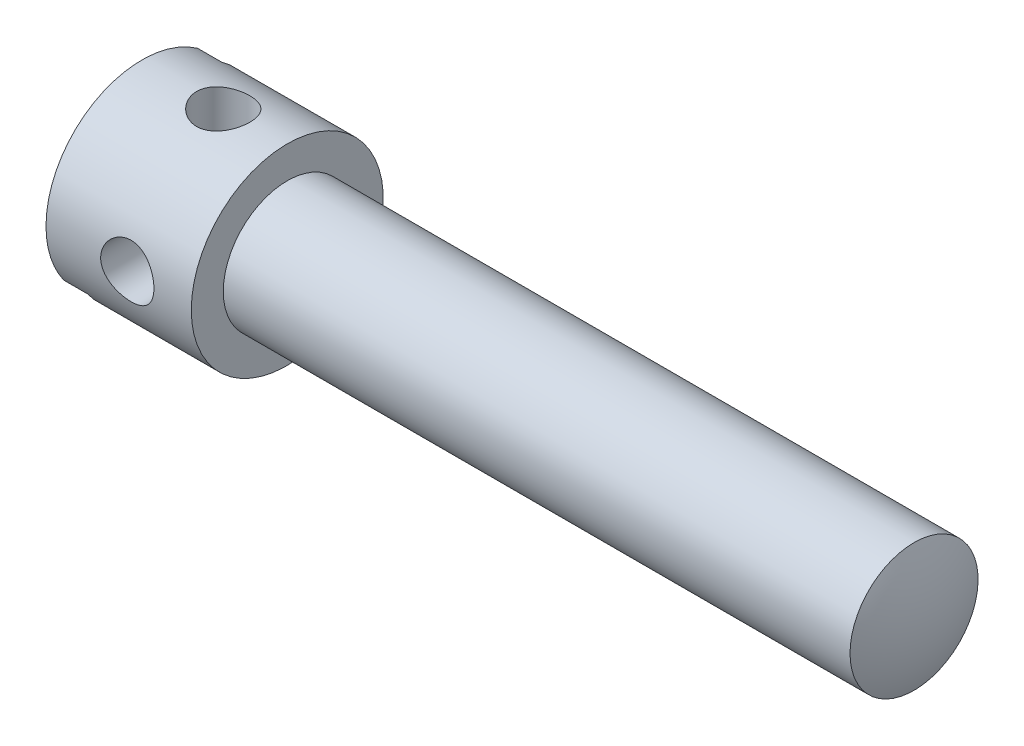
ISO-10303-21;
HEADER;
FILE_DESCRIPTION(('STEP AP214'),'2;1');
FILE_NAME('part.step','',(''),(''),'','','');
FILE_SCHEMA(('AUTOMOTIVE_DESIGN { 1 0 10303 214 1 1 1 1 }'));
ENDSEC;
DATA;
#1=APPLICATION_CONTEXT('core data for automotive mechanical design processes');
#2=APPLICATION_PROTOCOL_DEFINITION('international standard','automotive_design',2000,#1);
#3=PRODUCT_CONTEXT('',#1,'mechanical');
#4=PRODUCT('Part','Part','',(#3));
#5=PRODUCT_RELATED_PRODUCT_CATEGORY('part','',(#4));
#6=PRODUCT_DEFINITION_FORMATION('','',#4);
#7=PRODUCT_DEFINITION_CONTEXT('part definition',#1,'design');
#8=PRODUCT_DEFINITION('design','',#6,#7);
#9=PRODUCT_DEFINITION_SHAPE('','',#8);
#10=(LENGTH_UNIT() NAMED_UNIT(*) SI_UNIT(.MILLI.,.METRE.));
#11=(NAMED_UNIT(*) PLANE_ANGLE_UNIT() SI_UNIT($,.RADIAN.));
#12=(NAMED_UNIT(*) SI_UNIT($,.STERADIAN.) SOLID_ANGLE_UNIT());
#13=UNCERTAINTY_MEASURE_WITH_UNIT(LENGTH_MEASURE(1.E-05),#10,'distance_accuracy_value','');
#14=(GEOMETRIC_REPRESENTATION_CONTEXT(3) GLOBAL_UNCERTAINTY_ASSIGNED_CONTEXT((#13)) GLOBAL_UNIT_ASSIGNED_CONTEXT((#10,
#11,#12)) REPRESENTATION_CONTEXT('',''));
#15=CARTESIAN_POINT('',(0.,0.,0.));
#16=DIRECTION('',(0.,0.,1.));
#17=DIRECTION('',(1.,0.,0.));
#18=AXIS2_PLACEMENT_3D('',#15,#16,#17);
#19=CARTESIAN_POINT('',(25.,0.,0.));
#20=DIRECTION('',(-1.,0.,0.));
#21=DIRECTION('',(0.,1.,0.));
#22=AXIS2_PLACEMENT_3D('',#19,#20,#21);
#23=SPHERICAL_SURFACE('',#22,25.);
#24=CARTESIAN_POINT('',(1.15151996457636,0.,0.));
#25=DIRECTION('',(-1.,0.,0.));
#26=DIRECTION('',(0.,0.,1.));
#27=AXIS2_PLACEMENT_3D('',#24,#25,#26);
#28=CIRCLE('',#27,7.5);
#29=CARTESIAN_POINT('',(1.15151996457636,-4.34524168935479,6.11300864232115));
#30=VERTEX_POINT('',#29);
#31=CARTESIAN_POINT('',(1.15151996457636,6.11300864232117,-4.34524168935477));
#32=VERTEX_POINT('',#31);
#33=EDGE_CURVE('E186',#30,#32,#28,.T.);
#34=ORIENTED_EDGE('',*,*,#33,.T.);
#35=CARTESIAN_POINT('',(25.,0.883883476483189,0.883883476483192));
#36=DIRECTION('',(0.,0.707106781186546,0.707106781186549));
#37=DIRECTION('',(0.,-0.707106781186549,0.707106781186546));
#38=AXIS2_PLACEMENT_3D('',#35,#36,#37);
#39=CIRCLE('',#38,24.9687304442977);
#40=EDGE_CURVE('E210',#32,#30,#39,.T.);
#41=ORIENTED_EDGE('',*,*,#40,.T.);
#42=EDGE_LOOP('',(#34,#41));
#43=FACE_BOUND('',#42,.T.);
#44=ADVANCED_FACE('F43',(#43),#23,.T.);
#45=CARTESIAN_POINT('',(7.5,0.,-70.));
#46=DIRECTION('',(0.,0.,1.));
#47=DIRECTION('',(1.,0.,0.));
#48=AXIS2_PLACEMENT_3D('',#45,#46,#47);
#49=CYLINDRICAL_SURFACE('',#48,2.08);
#50=CARTESIAN_POINT('',(9.58,0.,7.5));
#51=CARTESIAN_POINT('',(9.57999765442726,-0.114492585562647,7.49999846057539));
#52=CARTESIAN_POINT('',(9.57051511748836,-0.229009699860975,7.49735271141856));
#53=CARTESIAN_POINT('',(9.5329096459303,-0.454733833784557,7.48705567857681));
#54=CARTESIAN_POINT('',(9.50477880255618,-0.565939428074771,7.47940227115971));
#55=CARTESIAN_POINT('',(9.43087004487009,-0.781750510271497,7.45993278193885));
#56=CARTESIAN_POINT('',(9.3851159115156,-0.88636467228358,7.44812231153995));
#57=CARTESIAN_POINT('',(9.27735045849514,-1.0864353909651,7.42158043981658));
#58=CARTESIAN_POINT('',(9.21533770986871,-1.18189114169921,7.40684878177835));
#59=CARTESIAN_POINT('',(9.0751855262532,-1.36331283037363,7.37563887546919));
#60=CARTESIAN_POINT('',(8.99671589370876,-1.4490182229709,7.35912888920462));
#61=CARTESIAN_POINT('',(8.82658257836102,-1.60623720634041,7.32642231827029));
#62=CARTESIAN_POINT('',(8.73491704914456,-1.67774880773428,7.31022577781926));
#63=CARTESIAN_POINT('',(8.53887601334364,-1.80585129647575,7.27965195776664));
#64=CARTESIAN_POINT('',(8.43429419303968,-1.86213684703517,7.26531454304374));
#65=CARTESIAN_POINT('',(8.21668912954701,-1.95622066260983,7.24055137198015));
#66=CARTESIAN_POINT('',(8.10366759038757,-1.99402264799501,7.23012482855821));
#67=CARTESIAN_POINT('',(7.87528987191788,-2.04915069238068,7.21469256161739));
#68=CARTESIAN_POINT('',(7.76005702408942,-2.06695166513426,7.20956135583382));
#69=CARTESIAN_POINT('',(7.52813509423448,-2.08305379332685,7.20492631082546));
#70=CARTESIAN_POINT('',(7.41144631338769,-2.0813589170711,7.20542132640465));
#71=CARTESIAN_POINT('',(7.18367824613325,-2.05889324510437,7.21187081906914));
#72=CARTESIAN_POINT('',(7.07253621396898,-2.03870319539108,7.21765907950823));
#73=CARTESIAN_POINT('',(6.8552826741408,-1.9807529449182,7.23377587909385));
#74=CARTESIAN_POINT('',(6.74917159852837,-1.94299123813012,7.24410480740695));
#75=CARTESIAN_POINT('',(6.54350723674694,-1.85051061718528,7.26828106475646));
#76=CARTESIAN_POINT('',(6.44404837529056,-1.79559285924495,7.2821692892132));
#77=CARTESIAN_POINT('',(6.25555664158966,-1.67049757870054,7.31187802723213));
#78=CARTESIAN_POINT('',(6.16652597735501,-1.60031683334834,7.32769894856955));
#79=CARTESIAN_POINT('',(5.99810698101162,-1.4437445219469,7.36017690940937));
#80=CARTESIAN_POINT('',(5.91917164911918,-1.35686697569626,7.37684371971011));
#81=CARTESIAN_POINT('',(5.77689387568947,-1.17090219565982,7.40863506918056));
#82=CARTESIAN_POINT('',(5.71355215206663,-1.07181440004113,7.42375953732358));
#83=CARTESIAN_POINT('',(5.60403739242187,-0.863503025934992,7.45086807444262));
#84=CARTESIAN_POINT('',(5.55795200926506,-0.754231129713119,7.46283602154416));
#85=CARTESIAN_POINT('',(5.48493939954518,-0.529081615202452,7.4821667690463));
#86=CARTESIAN_POINT('',(5.45800763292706,-0.41320556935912,7.48953066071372));
#87=CARTESIAN_POINT('',(5.42479116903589,-0.181998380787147,7.49865620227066));
#88=CARTESIAN_POINT('',(5.41789121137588,-0.0667620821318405,7.50058473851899));
#89=CARTESIAN_POINT('',(5.42322729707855,0.163223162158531,7.49910510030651));
#90=CARTESIAN_POINT('',(5.43546118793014,0.277972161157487,7.495697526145));
#91=CARTESIAN_POINT('',(5.4782150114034,0.501490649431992,7.48403684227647));
#92=CARTESIAN_POINT('',(5.50838673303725,0.61033200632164,7.47587606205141));
#93=CARTESIAN_POINT('',(5.58575091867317,0.821393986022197,7.45563962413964));
#94=CARTESIAN_POINT('',(5.63294529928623,0.923613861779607,7.44356352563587));
#95=CARTESIAN_POINT('',(5.74412250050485,1.1208830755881,7.41645117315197));
#96=CARTESIAN_POINT('',(5.8084333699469,1.21573960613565,7.40135869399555));
#97=CARTESIAN_POINT('',(5.95161000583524,1.39352869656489,7.36995536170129));
#98=CARTESIAN_POINT('',(6.03047888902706,1.47645869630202,7.35364424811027));
#99=CARTESIAN_POINT('',(6.2034116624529,1.63067029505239,7.32101948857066));
#100=CARTESIAN_POINT('',(6.2978675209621,1.70151642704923,7.30472112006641));
#101=CARTESIAN_POINT('',(6.4976761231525,1.8263685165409,7.27451163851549));
#102=CARTESIAN_POINT('',(6.60302844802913,1.88037512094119,7.26060043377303));
#103=CARTESIAN_POINT('',(6.82115738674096,1.96961321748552,7.23690244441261));
#104=CARTESIAN_POINT('',(6.93388865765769,2.00494913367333,7.22709278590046));
#105=CARTESIAN_POINT('',(7.16401517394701,2.05606336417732,7.21271945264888));
#106=CARTESIAN_POINT('',(7.28140909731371,2.07184718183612,7.20815430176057));
#107=CARTESIAN_POINT('',(7.51305089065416,2.08307407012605,7.20491718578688));
#108=CARTESIAN_POINT('',(7.62726234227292,2.07921992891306,7.20604159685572));
#109=CARTESIAN_POINT('',(7.8533385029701,2.05292513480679,7.21357619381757));
#110=CARTESIAN_POINT('',(7.96520328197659,2.03048503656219,7.21998622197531));
#111=CARTESIAN_POINT('',(8.1824450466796,1.9680777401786,7.23724366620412));
#112=CARTESIAN_POINT('',(8.28787156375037,1.92827091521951,7.24805042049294));
#113=CARTESIAN_POINT('',(8.49063151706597,1.83238418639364,7.27288182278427));
#114=CARTESIAN_POINT('',(8.58796358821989,1.77630154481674,7.28690701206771));
#115=CARTESIAN_POINT('',(8.77509796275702,1.64737376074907,7.31714896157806));
#116=CARTESIAN_POINT('',(8.86456475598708,1.57405456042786,7.33342100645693));
#117=CARTESIAN_POINT('',(9.03015311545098,1.41362153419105,7.36602767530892));
#118=CARTESIAN_POINT('',(9.10627137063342,1.3265042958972,7.3823623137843));
#119=CARTESIAN_POINT('',(9.244784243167,1.13845689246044,7.41371725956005));
#120=CARTESIAN_POINT('',(9.30681069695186,1.03724820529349,7.42869722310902));
#121=CARTESIAN_POINT('',(9.41287298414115,0.825425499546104,7.45520168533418));
#122=CARTESIAN_POINT('',(9.45691942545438,0.714817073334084,7.46672822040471));
#123=CARTESIAN_POINT('',(9.52057047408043,0.503981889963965,7.48368314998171));
#124=CARTESIAN_POINT('',(9.54280223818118,0.404592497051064,7.48975559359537));
#125=CARTESIAN_POINT('',(9.57251717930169,0.203475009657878,7.49791446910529));
#126=CARTESIAN_POINT('',(9.58000208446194,0.101747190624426,7.50000136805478));
#127=CARTESIAN_POINT('',(9.58,0.,7.5));
#128=B_SPLINE_CURVE_WITH_KNOTS('',3,(#50,#51,#52,#53,#54,#55,#56,#57,#58,#59,#60,#61,#62,#63,
#64,#65,#66,#67,#68,#69,#70,#71,#72,#73,#74,#75,#76,#77,#78,#79,#80,#81,#82,#83,#84,#85,#86,#87,
#88,#89,#90,#91,#92,#93,#94,#95,#96,#97,#98,#99,#100,#101,#102,#103,#104,#105,#106,#107,#108,
#109,#110,#111,#112,#113,#114,#115,#116,#117,#118,#119,#120,#121,#122,#123,#124,#125,#126,#127),
.UNSPECIFIED.,.T.,.F.,(4,2,2,2,2,2,2,2,2,2,2,2,2,2,2,2,2,2,2,2,2,2,2,2,2,2,2,2,2,2,2,2,2,2,2,2,
2,2,4),(0.,0.343104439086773,0.686354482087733,1.02914295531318,1.37196156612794,
1.72246124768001,2.07301002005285,2.43014019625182,2.78719845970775,3.13558652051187,
3.48390366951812,3.82164520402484,4.15941569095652,4.50125615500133,4.84316886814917,
5.19718726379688,5.55122195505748,5.90703131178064,6.2627563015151,6.60743352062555,
6.952071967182,7.29022919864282,7.62842451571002,7.973637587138,8.31892465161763,
8.67480584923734,9.0306733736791,9.38452890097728,9.73828480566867,10.0794716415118,
10.420648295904,10.7587389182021,11.0968864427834,11.4457287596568,11.7946574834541,
12.1518590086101,12.5088494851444,12.8137950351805,13.1187048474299),.UNSPECIFIED.);
#129=CARTESIAN_POINT('',(9.58,0.,7.5));
#130=VERTEX_POINT('',#129);
#131=EDGE_CURVE('E129',#130,#130,#128,.T.);
#132=ORIENTED_EDGE('',*,*,#131,.F.);
#133=EDGE_LOOP('',(#132));
#134=FACE_BOUND('',#133,.T.);
#135=CARTESIAN_POINT('',(7.5,0.,0.));
#136=DIRECTION('',(0.,-0.707106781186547,0.707106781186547));
#137=DIRECTION('',(0.,0.707106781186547,0.707106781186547));
#138=AXIS2_PLACEMENT_3D('',#135,#136,#137);
#139=ELLIPSE('',#138,2.94156420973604,2.08);
#140=CARTESIAN_POINT('',(5.42,0.,0.));
#141=VERTEX_POINT('',#140);
#142=CARTESIAN_POINT('',(9.58,0.,0.));
#143=VERTEX_POINT('',#142);
#144=EDGE_CURVE('E65',#141,#143,#139,.F.);
#145=ORIENTED_EDGE('',*,*,#144,.T.);
#146=CARTESIAN_POINT('',(7.5,0.,0.));
#147=DIRECTION('',(0.,0.707106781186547,0.707106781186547));
#148=DIRECTION('',(0.,-0.707106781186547,0.707106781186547));
#149=AXIS2_PLACEMENT_3D('',#146,#147,#148);
#150=ELLIPSE('',#149,2.94156420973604,2.08);
#151=EDGE_CURVE('E118',#143,#141,#150,.F.);
#152=ORIENTED_EDGE('',*,*,#151,.T.);
#153=EDGE_LOOP('',(#145,#152));
#154=FACE_BOUND('',#153,.T.);
#155=ADVANCED_FACE('F153',(#134,#154),#49,.F.);
#156=CARTESIAN_POINT('',(12.5,7.5,0.));
#157=DIRECTION('',(-1.,0.,0.));
#158=DIRECTION('',(0.,0.,1.));
#159=AXIS2_PLACEMENT_3D('',#156,#157,#158);
#160=PLANE('',#159);
#161=CARTESIAN_POINT('',(12.5,0.,0.));
#162=DIRECTION('',(-1.,0.,0.));
#163=DIRECTION('',(0.,0.,1.));
#164=AXIS2_PLACEMENT_3D('',#161,#162,#163);
#165=CIRCLE('',#164,7.5);
#166=CARTESIAN_POINT('',(12.5,0.,7.5));
#167=VERTEX_POINT('',#166);
#168=EDGE_CURVE('E185',#167,#167,#165,.T.);
#169=ORIENTED_EDGE('',*,*,#168,.F.);
#170=EDGE_LOOP('',(#169));
#171=FACE_BOUND('',#170,.T.);
#172=CARTESIAN_POINT('',(12.5,0.,0.));
#173=DIRECTION('',(-1.,0.,0.));
#174=DIRECTION('',(0.,0.,1.));
#175=AXIS2_PLACEMENT_3D('',#172,#173,#174);
#176=CIRCLE('',#175,5.);
#177=CARTESIAN_POINT('',(12.5,0.,5.));
#178=VERTEX_POINT('',#177);
#179=EDGE_CURVE('E128',#178,#178,#176,.F.);
#180=ORIENTED_EDGE('',*,*,#179,.F.);
#181=EDGE_LOOP('',(#180));
#182=FACE_BOUND('',#181,.T.);
#183=ADVANCED_FACE('F176',(#171,#182),#160,.F.);
#184=CARTESIAN_POINT('',(1.15151996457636,4.3452416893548,-6.11300864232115));
#185=VERTEX_POINT('',#184);
#186=CARTESIAN_POINT('',(1.15151996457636,-6.11300864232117,4.34524168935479));
#187=VERTEX_POINT('',#186);
#188=EDGE_CURVE('E184',#185,#187,#28,.T.);
#189=ORIENTED_EDGE('',*,*,#188,.T.);
#190=CARTESIAN_POINT('',(25.,-0.883883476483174,-0.883883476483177));
#191=DIRECTION('',(0.,-0.707106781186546,-0.707106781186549));
#192=DIRECTION('',(0.,0.707106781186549,-0.707106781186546));
#193=AXIS2_PLACEMENT_3D('',#190,#191,#192);
#194=CIRCLE('',#193,24.9687304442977);
#195=EDGE_CURVE('E95',#187,#185,#194,.T.);
#196=ORIENTED_EDGE('',*,*,#195,.T.);
#197=EDGE_LOOP('',(#189,#196));
#198=FACE_BOUND('',#197,.T.);
#199=ADVANCED_FACE('F45',(#198),#23,.T.);
#200=CARTESIAN_POINT('',(-25.0595434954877,0.,0.));
#201=DIRECTION('',(-1.,0.,0.));
#202=DIRECTION('',(0.,0.,1.));
#203=AXIS2_PLACEMENT_3D('',#200,#201,#202);
#204=CYLINDRICAL_SURFACE('',#203,7.5);
#205=CARTESIAN_POINT('',(7.5,-7.20580321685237,2.08));
#206=CARTESIAN_POINT('',(7.61439705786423,-7.20580500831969,2.07999761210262));
#207=CARTESIAN_POINT('',(7.72881871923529,-7.2085572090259,2.07053034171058));
#208=CARTESIAN_POINT('',(7.95434497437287,-7.21923238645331,2.0329909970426));
#209=CARTESIAN_POINT('',(8.06544805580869,-7.2271576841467,2.00491057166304));
#210=CARTESIAN_POINT('',(8.28104152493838,-7.24721395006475,1.93114911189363));
#211=CARTESIAN_POINT('',(8.38554146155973,-7.25933867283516,1.88549420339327));
#212=CARTESIAN_POINT('',(8.58541813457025,-7.28641953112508,1.77796294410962));
#213=CARTESIAN_POINT('',(8.68079395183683,-7.30137595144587,1.71608496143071));
#214=CARTESIAN_POINT('',(8.8622945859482,-7.33288843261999,1.57607364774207));
#215=CARTESIAN_POINT('',(8.9481360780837,-7.34947467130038,1.49757974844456));
#216=CARTESIAN_POINT('',(9.1056209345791,-7.382118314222,1.32733938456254));
#217=CARTESIAN_POINT('',(9.17726272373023,-7.39817565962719,1.2355914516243));
#218=CARTESIAN_POINT('',(9.30551097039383,-7.42829091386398,1.03946708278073));
#219=CARTESIAN_POINT('',(9.36183353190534,-7.44230908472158,0.934898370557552));
#220=CARTESIAN_POINT('',(9.45598926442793,-7.46641892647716,0.717321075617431));
#221=CARTESIAN_POINT('',(9.49382581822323,-7.47651131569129,0.604314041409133));
#222=CARTESIAN_POINT('',(9.54901218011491,-7.49141902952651,0.376027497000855));
#223=CARTESIAN_POINT('',(9.56684446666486,-7.49635842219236,0.26087286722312));
#224=CARTESIAN_POINT('',(9.58303641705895,-7.50083836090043,0.0291075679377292));
#225=CARTESIAN_POINT('',(9.58139959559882,-7.50037988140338,-0.0875028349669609));
#226=CARTESIAN_POINT('',(9.55903466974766,-7.49420565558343,-0.315503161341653));
#227=CARTESIAN_POINT('',(9.53882819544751,-7.48863355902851,-0.426948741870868));
#228=CARTESIAN_POINT('',(9.48074314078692,-7.47302924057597,-0.644800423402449));
#229=CARTESIAN_POINT('',(9.44286351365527,-7.46299675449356,-0.751206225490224));
#230=CARTESIAN_POINT('',(9.35012223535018,-7.43939033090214,-0.957261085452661));
#231=CARTESIAN_POINT('',(9.29508643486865,-7.42578031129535,-1.05682745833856));
#232=CARTESIAN_POINT('',(9.16972990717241,-7.39647836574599,-1.24548609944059));
#233=CARTESIAN_POINT('',(9.09940599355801,-7.38078600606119,-1.33457617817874));
#234=CARTESIAN_POINT('',(8.94271950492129,-7.34840005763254,-1.50286745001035));
#235=CARTESIAN_POINT('',(8.85590275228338,-7.33169052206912,-1.58164323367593));
#236=CARTESIAN_POINT('',(8.67012025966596,-7.29961810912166,-1.72362645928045));
#237=CARTESIAN_POINT('',(8.57115364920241,-7.28425532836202,-1.78683278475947));
#238=CARTESIAN_POINT('',(8.36289817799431,-7.2565478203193,-1.89624258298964));
#239=CARTESIAN_POINT('',(8.25354065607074,-7.24422542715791,-1.94232142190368));
#240=CARTESIAN_POINT('',(8.02820206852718,-7.22426670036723,-2.01529599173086));
#241=CARTESIAN_POINT('',(7.9122228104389,-7.21662909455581,-2.04219693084));
#242=CARTESIAN_POINT('',(7.68093351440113,-7.20717831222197,-2.07529988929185));
#243=CARTESIAN_POINT('',(7.5657220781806,-7.20518558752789,-2.08214023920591));
#244=CARTESIAN_POINT('',(7.33579975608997,-7.20675730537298,-2.07669397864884));
#245=CARTESIAN_POINT('',(7.22108881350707,-7.21032110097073,-2.06440959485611));
#246=CARTESIAN_POINT('',(6.99794448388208,-7.22242999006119,-2.0216272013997));
#247=CARTESIAN_POINT('',(6.88942954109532,-7.23086777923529,-1.99152120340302));
#248=CARTESIAN_POINT('',(6.67899179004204,-7.251667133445,-1.9143951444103));
#249=CARTESIAN_POINT('',(6.57706989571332,-7.26402924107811,-1.86737274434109));
#250=CARTESIAN_POINT('',(6.38006369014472,-7.29164653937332,-1.75647931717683));
#251=CARTESIAN_POINT('',(6.2851965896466,-7.30696293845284,-1.69223801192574));
#252=CARTESIAN_POINT('',(6.10735486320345,-7.33862301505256,-1.54918329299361));
#253=CARTESIAN_POINT('',(6.02438266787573,-7.35496690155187,-1.47036690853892));
#254=CARTESIAN_POINT('',(5.86999276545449,-7.38746497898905,-1.29743163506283));
#255=CARTESIAN_POINT('',(5.79902253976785,-7.40359689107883,-1.2029081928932));
#256=CARTESIAN_POINT('',(5.67395182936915,-7.43332697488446,-1.00292276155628));
#257=CARTESIAN_POINT('',(5.61985045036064,-7.44692528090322,-0.8974613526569));
#258=CARTESIAN_POINT('',(5.5305624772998,-7.46996851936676,-0.679332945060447));
#259=CARTESIAN_POINT('',(5.49523302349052,-7.47944471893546,-0.566727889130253));
#260=CARTESIAN_POINT('',(5.44408935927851,-7.49331396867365,-0.336874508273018));
#261=CARTESIAN_POINT('',(5.42827044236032,-7.49770824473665,-0.219627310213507));
#262=CARTESIAN_POINT('',(5.41691155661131,-7.50085543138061,0.012016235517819));
#263=CARTESIAN_POINT('',(5.42071765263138,-7.49979026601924,0.126378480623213));
#264=CARTESIAN_POINT('',(5.44696855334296,-7.49255502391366,0.352769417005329));
#265=CARTESIAN_POINT('',(5.46941255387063,-7.48638516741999,0.464798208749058));
#266=CARTESIAN_POINT('',(5.53192072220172,-7.46967498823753,0.682487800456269));
#267=CARTESIAN_POINT('',(5.57184268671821,-7.45916997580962,0.788192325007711));
#268=CARTESIAN_POINT('',(5.66804704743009,-7.43488350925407,0.991462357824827));
#269=CARTESIAN_POINT('',(5.72433187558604,-7.4211015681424,1.08902665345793));
#270=CARTESIAN_POINT('',(5.85352439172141,-7.39124008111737,1.27625185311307));
#271=CARTESIAN_POINT('',(5.92685863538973,-7.37510641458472,1.36560974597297));
#272=CARTESIAN_POINT('',(6.0872720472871,-7.34256376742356,1.53097176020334));
#273=CARTESIAN_POINT('',(6.174354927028,-7.32615471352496,1.60697226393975));
#274=CARTESIAN_POINT('',(6.36234048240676,-7.29445625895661,1.74530133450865));
#275=CARTESIAN_POINT('',(6.46352779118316,-7.27920380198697,1.8072523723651));
#276=CARTESIAN_POINT('',(6.67529227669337,-7.25208625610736,1.91317895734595));
#277=CARTESIAN_POINT('',(6.78586374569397,-7.24021912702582,1.95716533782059));
#278=CARTESIAN_POINT('',(6.99655703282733,-7.22272068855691,2.02069847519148));
#279=CARTESIAN_POINT('',(7.09583644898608,-7.21643050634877,2.04288167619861));
#280=CARTESIAN_POINT('',(7.29673765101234,-7.20797125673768,2.07253249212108));
#281=CARTESIAN_POINT('',(7.39835911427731,-7.20580162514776,2.08000212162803));
#282=CARTESIAN_POINT('',(7.5,-7.20580321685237,2.08));
#283=B_SPLINE_CURVE_WITH_KNOTS('',3,(#205,#206,#207,#208,#209,#210,#211,#212,#213,#214,#215,
#216,#217,#218,#219,#220,#221,#222,#223,#224,#225,#226,#227,#228,#229,#230,#231,#232,#233,#234,
#235,#236,#237,#238,#239,#240,#241,#242,#243,#244,#245,#246,#247,#248,#249,#250,#251,#252,#253,
#254,#255,#256,#257,#258,#259,#260,#261,#262,#263,#264,#265,#266,#267,#268,#269,#270,#271,#272,
#273,#274,#275,#276,#277,#278,#279,#280,#281,#282),.UNSPECIFIED.,.T.,.F.,(4,2,2,2,2,2,2,2,2,2,2,
2,2,2,2,2,2,2,2,2,2,2,2,2,2,2,2,2,2,2,2,2,2,2,2,2,2,2,4),(0.,0.342817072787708,
0.685788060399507,1.02825115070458,1.37074870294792,1.72162331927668,2.07253683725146,
2.42956807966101,2.78653396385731,3.1346916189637,3.48278642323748,3.82139242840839,
4.16001849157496,4.50220042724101,4.84445375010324,5.19804604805,5.55166369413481,
5.90780639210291,6.26385233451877,6.60843890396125,6.95298535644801,7.29022077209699,
7.62750283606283,7.97271802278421,8.31800365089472,8.6741901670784,9.03035779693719,
9.38377459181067,9.73710611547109,10.0787417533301,10.4203626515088,10.7592542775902,
11.0981962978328,11.4467608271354,11.7954196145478,12.1525593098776,12.509483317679,
12.8141153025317,13.1187055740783),.UNSPECIFIED.);
#284=CARTESIAN_POINT('',(7.5,-7.20580321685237,2.08));
#285=VERTEX_POINT('',#284);
#286=EDGE_CURVE('E192',#285,#285,#283,.T.);
#287=ORIENTED_EDGE('',*,*,#286,.T.);
#288=EDGE_LOOP('',(#287));
#289=FACE_BOUND('',#288,.T.);
#290=CARTESIAN_POINT('',(7.5,7.20580321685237,2.08));
#291=CARTESIAN_POINT('',(7.38560294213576,7.20580500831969,2.07999761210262));
#292=CARTESIAN_POINT('',(7.2711812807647,7.2085572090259,2.07053034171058));
#293=CARTESIAN_POINT('',(7.04565502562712,7.21923238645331,2.0329909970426));
#294=CARTESIAN_POINT('',(6.9345519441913,7.2271576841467,2.00491057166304));
#295=CARTESIAN_POINT('',(6.71895847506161,7.24721395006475,1.93114911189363));
#296=CARTESIAN_POINT('',(6.61445853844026,7.25933867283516,1.88549420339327));
#297=CARTESIAN_POINT('',(6.41458186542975,7.28641953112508,1.77796294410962));
#298=CARTESIAN_POINT('',(6.31920604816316,7.30137595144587,1.71608496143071));
#299=CARTESIAN_POINT('',(6.13770541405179,7.33288843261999,1.57607364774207));
#300=CARTESIAN_POINT('',(6.0518639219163,7.34947467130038,1.49757974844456));
#301=CARTESIAN_POINT('',(5.89437906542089,7.382118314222,1.32733938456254));
#302=CARTESIAN_POINT('',(5.82273727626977,7.39817565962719,1.2355914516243));
#303=CARTESIAN_POINT('',(5.69448902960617,7.42829091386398,1.03946708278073));
#304=CARTESIAN_POINT('',(5.63816646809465,7.44230908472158,0.934898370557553));
#305=CARTESIAN_POINT('',(5.54401073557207,7.46641892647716,0.717321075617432));
#306=CARTESIAN_POINT('',(5.50617418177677,7.47651131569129,0.604314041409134));
#307=CARTESIAN_POINT('',(5.45098781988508,7.49141902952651,0.376027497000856));
#308=CARTESIAN_POINT('',(5.43315553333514,7.49635842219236,0.260872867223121));
#309=CARTESIAN_POINT('',(5.41696358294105,7.50083836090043,0.0291075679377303));
#310=CARTESIAN_POINT('',(5.41860040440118,7.50037988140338,-0.0875028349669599));
#311=CARTESIAN_POINT('',(5.44096533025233,7.49420565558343,-0.315503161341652));
#312=CARTESIAN_POINT('',(5.46117180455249,7.48863355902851,-0.426948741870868));
#313=CARTESIAN_POINT('',(5.51925685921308,7.47302924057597,-0.644800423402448));
#314=CARTESIAN_POINT('',(5.55713648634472,7.46299675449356,-0.751206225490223));
#315=CARTESIAN_POINT('',(5.64987776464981,7.43939033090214,-0.957261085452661));
#316=CARTESIAN_POINT('',(5.70491356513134,7.42578031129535,-1.05682745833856));
#317=CARTESIAN_POINT('',(5.83027009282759,7.39647836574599,-1.24548609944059));
#318=CARTESIAN_POINT('',(5.90059400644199,7.38078600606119,-1.33457617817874));
#319=CARTESIAN_POINT('',(6.05728049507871,7.34840005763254,-1.50286745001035));
#320=CARTESIAN_POINT('',(6.14409724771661,7.33169052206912,-1.58164323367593));
#321=CARTESIAN_POINT('',(6.32987974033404,7.29961810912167,-1.72362645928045));
#322=CARTESIAN_POINT('',(6.42884635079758,7.28425532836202,-1.78683278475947));
#323=CARTESIAN_POINT('',(6.63710182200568,7.2565478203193,-1.89624258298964));
#324=CARTESIAN_POINT('',(6.74645934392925,7.24422542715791,-1.94232142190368));
#325=CARTESIAN_POINT('',(6.97179793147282,7.22426670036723,-2.01529599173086));
#326=CARTESIAN_POINT('',(7.08777718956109,7.21662909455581,-2.04219693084));
#327=CARTESIAN_POINT('',(7.31906648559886,7.20717831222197,-2.07529988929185));
#328=CARTESIAN_POINT('',(7.43427792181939,7.20518558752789,-2.08214023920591));
#329=CARTESIAN_POINT('',(7.66420024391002,7.20675730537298,-2.07669397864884));
#330=CARTESIAN_POINT('',(7.77891118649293,7.21032110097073,-2.06440959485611));
#331=CARTESIAN_POINT('',(8.00205551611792,7.22242999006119,-2.0216272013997));
#332=CARTESIAN_POINT('',(8.11057045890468,7.23086777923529,-1.99152120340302));
#333=CARTESIAN_POINT('',(8.32100820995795,7.251667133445,-1.9143951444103));
#334=CARTESIAN_POINT('',(8.42293010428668,7.26402924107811,-1.86737274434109));
#335=CARTESIAN_POINT('',(8.61993630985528,7.29164653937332,-1.75647931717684));
#336=CARTESIAN_POINT('',(8.7148034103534,7.30696293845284,-1.69223801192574));
#337=CARTESIAN_POINT('',(8.89264513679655,7.33862301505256,-1.54918329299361));
#338=CARTESIAN_POINT('',(8.97561733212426,7.35496690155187,-1.47036690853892));
#339=CARTESIAN_POINT('',(9.13000723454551,7.38746497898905,-1.29743163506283));
#340=CARTESIAN_POINT('',(9.20097746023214,7.40359689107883,-1.2029081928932));
#341=CARTESIAN_POINT('',(9.32604817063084,7.43332697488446,-1.00292276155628));
#342=CARTESIAN_POINT('',(9.38014954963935,7.44692528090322,-0.897461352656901));
#343=CARTESIAN_POINT('',(9.4694375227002,7.46996851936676,-0.679332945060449));
#344=CARTESIAN_POINT('',(9.50476697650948,7.47944471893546,-0.566727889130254));
#345=CARTESIAN_POINT('',(9.55591064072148,7.49331396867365,-0.336874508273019));
#346=CARTESIAN_POINT('',(9.57172955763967,7.49770824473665,-0.219627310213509));
#347=CARTESIAN_POINT('',(9.58308844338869,7.50085543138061,0.0120162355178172));
#348=CARTESIAN_POINT('',(9.57928234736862,7.49979026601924,0.126378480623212));
#349=CARTESIAN_POINT('',(9.55303144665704,7.49255502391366,0.352769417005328));
#350=CARTESIAN_POINT('',(9.53058744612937,7.48638516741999,0.464798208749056));
#351=CARTESIAN_POINT('',(9.46807927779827,7.46967498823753,0.682487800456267));
#352=CARTESIAN_POINT('',(9.42815731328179,7.45916997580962,0.788192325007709));
#353=CARTESIAN_POINT('',(9.33195295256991,7.43488350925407,0.991462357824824));
#354=CARTESIAN_POINT('',(9.27566812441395,7.4211015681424,1.08902665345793));
#355=CARTESIAN_POINT('',(9.14647560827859,7.39124008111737,1.27625185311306));
#356=CARTESIAN_POINT('',(9.07314136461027,7.37510641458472,1.36560974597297));
#357=CARTESIAN_POINT('',(8.9127279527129,7.34256376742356,1.53097176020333));
#358=CARTESIAN_POINT('',(8.825645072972,7.32615471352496,1.60697226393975));
#359=CARTESIAN_POINT('',(8.63765951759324,7.29445625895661,1.74530133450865));
#360=CARTESIAN_POINT('',(8.53647220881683,7.27920380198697,1.8072523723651));
#361=CARTESIAN_POINT('',(8.32470772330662,7.25208625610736,1.91317895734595));
#362=CARTESIAN_POINT('',(8.21413625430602,7.24021912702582,1.95716533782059));
#363=CARTESIAN_POINT('',(8.00344296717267,7.22272068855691,2.02069847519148));
#364=CARTESIAN_POINT('',(7.90416355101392,7.21643050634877,2.04288167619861));
#365=CARTESIAN_POINT('',(7.70326234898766,7.20797125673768,2.07253249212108));
#366=CARTESIAN_POINT('',(7.60164088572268,7.20580162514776,2.08000212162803));
#367=CARTESIAN_POINT('',(7.5,7.20580321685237,2.08));
#368=B_SPLINE_CURVE_WITH_KNOTS('',3,(#290,#291,#292,#293,#294,#295,#296,#297,#298,#299,#300,
#301,#302,#303,#304,#305,#306,#307,#308,#309,#310,#311,#312,#313,#314,#315,#316,#317,#318,#319,
#320,#321,#322,#323,#324,#325,#326,#327,#328,#329,#330,#331,#332,#333,#334,#335,#336,#337,#338,
#339,#340,#341,#342,#343,#344,#345,#346,#347,#348,#349,#350,#351,#352,#353,#354,#355,#356,#357,
#358,#359,#360,#361,#362,#363,#364,#365,#366,#367),.UNSPECIFIED.,.T.,.F.,(4,2,2,2,2,2,2,2,2,2,2,
2,2,2,2,2,2,2,2,2,2,2,2,2,2,2,2,2,2,2,2,2,2,2,2,2,2,2,4),(0.,0.34281707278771,0.685788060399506,
1.02825115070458,1.37074870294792,1.72162331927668,2.07253683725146,2.42956807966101,
2.78653396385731,3.13469161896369,3.48278642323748,3.82139242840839,4.16001849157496,
4.50220042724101,4.84445375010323,5.19804604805,5.55166369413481,5.90780639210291,
6.26385233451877,6.60843890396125,6.95298535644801,7.29022077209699,7.62750283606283,
7.97271802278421,8.31800365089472,8.6741901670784,9.03035779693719,9.38377459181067,
9.73710611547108,10.0787417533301,10.4203626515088,10.7592542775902,11.0981962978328,
11.4467608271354,11.7954196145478,12.1525593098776,12.509483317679,12.8141153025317,
13.1187055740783),.UNSPECIFIED.);
#369=CARTESIAN_POINT('',(7.5,7.20580321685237,2.08));
#370=VERTEX_POINT('',#369);
#371=EDGE_CURVE('E204',#370,#370,#368,.T.);
#372=ORIENTED_EDGE('',*,*,#371,.T.);
#373=EDGE_LOOP('',(#372));
#374=FACE_BOUND('',#373,.T.);
#375=ORIENTED_EDGE('',*,*,#131,.T.);
#376=EDGE_LOOP('',(#375));
#377=FACE_BOUND('',#376,.T.);
#378=CARTESIAN_POINT('',(9.58,0.,-7.5));
#379=CARTESIAN_POINT('',(9.57999765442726,0.114492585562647,-7.49999846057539));
#380=CARTESIAN_POINT('',(9.57051511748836,0.229009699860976,-7.49735271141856));
#381=CARTESIAN_POINT('',(9.5329096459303,0.454733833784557,-7.48705567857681));
#382=CARTESIAN_POINT('',(9.50477880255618,0.565939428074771,-7.47940227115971));
#383=CARTESIAN_POINT('',(9.43087004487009,0.781750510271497,-7.45993278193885));
#384=CARTESIAN_POINT('',(9.3851159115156,0.886364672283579,-7.44812231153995));
#385=CARTESIAN_POINT('',(9.27735045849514,1.0864353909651,-7.42158043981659));
#386=CARTESIAN_POINT('',(9.21533770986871,1.18189114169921,-7.40684878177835));
#387=CARTESIAN_POINT('',(9.0751855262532,1.36331283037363,-7.37563887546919));
#388=CARTESIAN_POINT('',(8.99671589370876,1.4490182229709,-7.35912888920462));
#389=CARTESIAN_POINT('',(8.82658257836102,1.60623720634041,-7.32642231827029));
#390=CARTESIAN_POINT('',(8.73491704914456,1.67774880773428,-7.31022577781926));
#391=CARTESIAN_POINT('',(8.53887601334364,1.80585129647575,-7.27965195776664));
#392=CARTESIAN_POINT('',(8.43429419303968,1.86213684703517,-7.26531454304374));
#393=CARTESIAN_POINT('',(8.21668912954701,1.95622066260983,-7.24055137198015));
#394=CARTESIAN_POINT('',(8.10366759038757,1.99402264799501,-7.23012482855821));
#395=CARTESIAN_POINT('',(7.87528987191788,2.04915069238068,-7.21469256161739));
#396=CARTESIAN_POINT('',(7.76005702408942,2.06695166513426,-7.20956135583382));
#397=CARTESIAN_POINT('',(7.52813509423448,2.08305379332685,-7.20492631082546));
#398=CARTESIAN_POINT('',(7.41144631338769,2.0813589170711,-7.20542132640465));
#399=CARTESIAN_POINT('',(7.18367824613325,2.05889324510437,-7.21187081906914));
#400=CARTESIAN_POINT('',(7.07253621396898,2.03870319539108,-7.21765907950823));
#401=CARTESIAN_POINT('',(6.8552826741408,1.9807529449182,-7.23377587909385));
#402=CARTESIAN_POINT('',(6.74917159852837,1.94299123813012,-7.24410480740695));
#403=CARTESIAN_POINT('',(6.54350723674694,1.85051061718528,-7.26828106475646));
#404=CARTESIAN_POINT('',(6.44404837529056,1.79559285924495,-7.2821692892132));
#405=CARTESIAN_POINT('',(6.25555664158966,1.67049757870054,-7.31187802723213));
#406=CARTESIAN_POINT('',(6.16652597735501,1.60031683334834,-7.32769894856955));
#407=CARTESIAN_POINT('',(5.99810698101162,1.4437445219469,-7.36017690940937));
#408=CARTESIAN_POINT('',(5.91917164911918,1.35686697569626,-7.37684371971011));
#409=CARTESIAN_POINT('',(5.77689387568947,1.17090219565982,-7.40863506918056));
#410=CARTESIAN_POINT('',(5.71355215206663,1.07181440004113,-7.42375953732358));
#411=CARTESIAN_POINT('',(5.60403739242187,0.863503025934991,-7.45086807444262));
#412=CARTESIAN_POINT('',(5.55795200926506,0.754231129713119,-7.46283602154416));
#413=CARTESIAN_POINT('',(5.48493939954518,0.529081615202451,-7.4821667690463));
#414=CARTESIAN_POINT('',(5.45800763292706,0.41320556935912,-7.48953066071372));
#415=CARTESIAN_POINT('',(5.42479116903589,0.181998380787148,-7.49865620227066));
#416=CARTESIAN_POINT('',(5.41789121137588,0.0667620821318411,-7.50058473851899));
#417=CARTESIAN_POINT('',(5.42322729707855,-0.16322316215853,-7.49910510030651));
#418=CARTESIAN_POINT('',(5.43546118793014,-0.277972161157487,-7.495697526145));
#419=CARTESIAN_POINT('',(5.4782150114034,-0.501490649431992,-7.48403684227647));
#420=CARTESIAN_POINT('',(5.50838673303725,-0.61033200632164,-7.47587606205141));
#421=CARTESIAN_POINT('',(5.58575091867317,-0.821393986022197,-7.45563962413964));
#422=CARTESIAN_POINT('',(5.63294529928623,-0.923613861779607,-7.44356352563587));
#423=CARTESIAN_POINT('',(5.74412250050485,-1.1208830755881,-7.41645117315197));
#424=CARTESIAN_POINT('',(5.8084333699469,-1.21573960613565,-7.40135869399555));
#425=CARTESIAN_POINT('',(5.95161000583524,-1.39352869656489,-7.36995536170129));
#426=CARTESIAN_POINT('',(6.03047888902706,-1.47645869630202,-7.35364424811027));
#427=CARTESIAN_POINT('',(6.2034116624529,-1.63067029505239,-7.32101948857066));
#428=CARTESIAN_POINT('',(6.2978675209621,-1.70151642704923,-7.30472112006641));
#429=CARTESIAN_POINT('',(6.4976761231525,-1.8263685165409,-7.27451163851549));
#430=CARTESIAN_POINT('',(6.60302844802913,-1.88037512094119,-7.26060043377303));
#431=CARTESIAN_POINT('',(6.82115738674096,-1.96961321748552,-7.23690244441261));
#432=CARTESIAN_POINT('',(6.93388865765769,-2.00494913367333,-7.22709278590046));
#433=CARTESIAN_POINT('',(7.16401517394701,-2.05606336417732,-7.21271945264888));
#434=CARTESIAN_POINT('',(7.28140909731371,-2.07184718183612,-7.20815430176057));
#435=CARTESIAN_POINT('',(7.51305089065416,-2.08307407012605,-7.20491718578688));
#436=CARTESIAN_POINT('',(7.62726234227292,-2.07921992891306,-7.20604159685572));
#437=CARTESIAN_POINT('',(7.8533385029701,-2.05292513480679,-7.21357619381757));
#438=CARTESIAN_POINT('',(7.96520328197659,-2.03048503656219,-7.21998622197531));
#439=CARTESIAN_POINT('',(8.1824450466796,-1.9680777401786,-7.23724366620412));
#440=CARTESIAN_POINT('',(8.28787156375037,-1.92827091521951,-7.24805042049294));
#441=CARTESIAN_POINT('',(8.49063151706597,-1.83238418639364,-7.27288182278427));
#442=CARTESIAN_POINT('',(8.58796358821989,-1.77630154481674,-7.28690701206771));
#443=CARTESIAN_POINT('',(8.77509796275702,-1.64737376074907,-7.31714896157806));
#444=CARTESIAN_POINT('',(8.86456475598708,-1.57405456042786,-7.33342100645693));
#445=CARTESIAN_POINT('',(9.03015311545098,-1.41362153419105,-7.36602767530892));
#446=CARTESIAN_POINT('',(9.10627137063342,-1.3265042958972,-7.3823623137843));
#447=CARTESIAN_POINT('',(9.244784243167,-1.13845689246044,-7.41371725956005));
#448=CARTESIAN_POINT('',(9.30681069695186,-1.03724820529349,-7.42869722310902));
#449=CARTESIAN_POINT('',(9.41287298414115,-0.825425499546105,-7.45520168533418));
#450=CARTESIAN_POINT('',(9.45691942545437,-0.714817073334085,-7.46672822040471));
#451=CARTESIAN_POINT('',(9.52057047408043,-0.503981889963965,-7.48368314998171));
#452=CARTESIAN_POINT('',(9.54280223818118,-0.404592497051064,-7.48975559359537));
#453=CARTESIAN_POINT('',(9.57251717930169,-0.203475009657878,-7.49791446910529));
#454=CARTESIAN_POINT('',(9.58000208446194,-0.101747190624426,-7.50000136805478));
#455=CARTESIAN_POINT('',(9.58,0.,-7.5));
#456=B_SPLINE_CURVE_WITH_KNOTS('',3,(#378,#379,#380,#381,#382,#383,#384,#385,#386,#387,#388,
#389,#390,#391,#392,#393,#394,#395,#396,#397,#398,#399,#400,#401,#402,#403,#404,#405,#406,#407,
#408,#409,#410,#411,#412,#413,#414,#415,#416,#417,#418,#419,#420,#421,#422,#423,#424,#425,#426,
#427,#428,#429,#430,#431,#432,#433,#434,#435,#436,#437,#438,#439,#440,#441,#442,#443,#444,#445,
#446,#447,#448,#449,#450,#451,#452,#453,#454,#455),.UNSPECIFIED.,.T.,.F.,(4,2,2,2,2,2,2,2,2,2,2,
2,2,2,2,2,2,2,2,2,2,2,2,2,2,2,2,2,2,2,2,2,2,2,2,2,2,2,4),(0.,0.343104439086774,
0.686354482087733,1.02914295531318,1.37196156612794,1.72246124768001,2.07301002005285,
2.43014019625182,2.78719845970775,3.13558652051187,3.48390366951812,3.82164520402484,
4.15941569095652,4.50125615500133,4.84316886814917,5.19718726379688,5.55122195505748,
5.90703131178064,6.2627563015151,6.60743352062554,6.952071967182,7.29022919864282,
7.62842451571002,7.973637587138,8.31892465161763,8.67480584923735,9.0306733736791,
9.38452890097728,9.73828480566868,10.0794716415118,10.420648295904,10.7587389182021,
11.0968864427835,11.4457287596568,11.7946574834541,12.1518590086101,12.5088494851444,
12.8137950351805,13.1187048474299),.UNSPECIFIED.);
#457=CARTESIAN_POINT('',(9.58,0.,-7.5));
#458=VERTEX_POINT('',#457);
#459=EDGE_CURVE('E138',#458,#458,#456,.T.);
#460=ORIENTED_EDGE('',*,*,#459,.T.);
#461=EDGE_LOOP('',(#460));
#462=FACE_BOUND('',#461,.T.);
#463=ORIENTED_EDGE('',*,*,#33,.F.);
#464=DIRECTION('',(-1.,0.,0.));
#465=VECTOR('',#464,1.);
#466=CARTESIAN_POINT('',(-25.0595434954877,-4.34524168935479,6.11300864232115));
#467=LINE('',#466,#465);
#468=CARTESIAN_POINT('',(3.,-4.34524168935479,6.11300864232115));
#469=VERTEX_POINT('',#468);
#470=EDGE_CURVE('E11',#30,#469,#467,.F.);
#471=ORIENTED_EDGE('',*,*,#470,.T.);
#472=CARTESIAN_POINT('',(3.,0.,0.));
#473=DIRECTION('',(1.,0.,0.));
#474=DIRECTION('',(0.,0.,-1.));
#475=AXIS2_PLACEMENT_3D('',#472,#473,#474);
#476=CIRCLE('',#475,7.5);
#477=CARTESIAN_POINT('',(3.,-6.11300864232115,4.34524168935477));
#478=VERTEX_POINT('',#477);
#479=EDGE_CURVE('E51',#469,#478,#476,.T.);
#480=ORIENTED_EDGE('',*,*,#479,.T.);
#481=DIRECTION('',(-1.,0.,0.));
#482=VECTOR('',#481,1.);
#483=CARTESIAN_POINT('',(-25.0595434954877,-6.11300864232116,4.34524168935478));
#484=LINE('',#483,#482);
#485=EDGE_CURVE('E92',#478,#187,#484,.T.);
#486=ORIENTED_EDGE('',*,*,#485,.T.);
#487=ORIENTED_EDGE('',*,*,#188,.F.);
#488=DIRECTION('',(-1.,0.,0.));
#489=VECTOR('',#488,1.);
#490=CARTESIAN_POINT('',(-25.0595434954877,4.3452416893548,-6.11300864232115));
#491=LINE('',#490,#489);
#492=CARTESIAN_POINT('',(3.,4.3452416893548,-6.11300864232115));
#493=VERTEX_POINT('',#492);
#494=EDGE_CURVE('E116',#185,#493,#491,.F.);
#495=ORIENTED_EDGE('',*,*,#494,.T.);
#496=CARTESIAN_POINT('',(3.,6.11300864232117,-4.34524168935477));
#497=VERTEX_POINT('',#496);
#498=EDGE_CURVE('E106',#493,#497,#476,.T.);
#499=ORIENTED_EDGE('',*,*,#498,.T.);
#500=DIRECTION('',(-1.,0.,0.));
#501=VECTOR('',#500,1.);
#502=CARTESIAN_POINT('',(-25.0595434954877,6.11300864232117,-4.34524168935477));
#503=LINE('',#502,#501);
#504=EDGE_CURVE('E100',#497,#32,#503,.T.);
#505=ORIENTED_EDGE('',*,*,#504,.T.);
#506=EDGE_LOOP('',(#463,#471,#480,#486,#487,#495,#499,#505));
#507=FACE_BOUND('',#506,.T.);
#508=ORIENTED_EDGE('',*,*,#168,.T.);
#509=EDGE_LOOP('',(#508));
#510=FACE_BOUND('',#509,.T.);
#511=ADVANCED_FACE('F111',(#289,#374,#377,#462,#507,#510),#204,.T.);
#512=CARTESIAN_POINT('',(62.4999999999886,0.,0.));
#513=DIRECTION('',(-1.,0.,0.));
#514=DIRECTION('',(0.,0.,1.));
#515=AXIS2_PLACEMENT_3D('',#512,#513,#514);
#516=CYLINDRICAL_SURFACE('',#515,5.);
#517=CARTESIAN_POINT('',(61.4564392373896,0.,0.));
#518=DIRECTION('',(-1.,0.,0.));
#519=DIRECTION('',(0.,0.,1.));
#520=AXIS2_PLACEMENT_3D('',#517,#518,#519);
#521=CIRCLE('',#520,5.);
#522=CARTESIAN_POINT('',(61.4564392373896,0.,5.));
#523=VERTEX_POINT('',#522);
#524=EDGE_CURVE('E137',#523,#523,#521,.T.);
#525=ORIENTED_EDGE('',*,*,#524,.T.);
#526=EDGE_LOOP('',(#525));
#527=FACE_BOUND('',#526,.T.);
#528=ORIENTED_EDGE('',*,*,#179,.T.);
#529=EDGE_LOOP('',(#528));
#530=FACE_BOUND('',#529,.T.);
#531=ADVANCED_FACE('F159',(#527,#530),#516,.T.);
#532=CARTESIAN_POINT('',(50.,0.,0.));
#533=DIRECTION('',(1.,0.,0.));
#534=DIRECTION('',(0.,1.,0.));
#535=AXIS2_PLACEMENT_3D('',#532,#533,#534);
#536=SPHERICAL_SURFACE('',#535,12.5);
#537=CARTESIAN_POINT('',(62.5,0.,0.));
#538=VERTEX_POINT('',#537);
#539=VERTEX_LOOP('',#538);
#540=FACE_BOUND('',#539,.T.);
#541=ORIENTED_EDGE('',*,*,#524,.F.);
#542=EDGE_LOOP('',(#541));
#543=FACE_BOUND('',#542,.T.);
#544=ADVANCED_FACE('F151',(#540,#543),#536,.T.);
#545=CARTESIAN_POINT('',(7.5,0.,0.));
#546=DIRECTION('',(0.,-0.707106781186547,0.707106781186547));
#547=DIRECTION('',(0.,0.707106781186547,0.707106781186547));
#548=AXIS2_PLACEMENT_3D('',#545,#546,#547);
#549=ELLIPSE('',#548,2.94156420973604,2.08);
#550=EDGE_CURVE('E124',#141,#143,#549,.T.);
#551=ORIENTED_EDGE('',*,*,#550,.T.);
#552=CARTESIAN_POINT('',(7.5,0.,0.));
#553=DIRECTION('',(0.,0.707106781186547,0.707106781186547));
#554=DIRECTION('',(0.,-0.707106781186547,0.707106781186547));
#555=AXIS2_PLACEMENT_3D('',#552,#553,#554);
#556=ELLIPSE('',#555,2.94156420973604,2.08);
#557=EDGE_CURVE('E119',#143,#141,#556,.T.);
#558=ORIENTED_EDGE('',*,*,#557,.T.);
#559=EDGE_LOOP('',(#551,#558));
#560=FACE_BOUND('',#559,.T.);
#561=ORIENTED_EDGE('',*,*,#459,.F.);
#562=EDGE_LOOP('',(#561));
#563=FACE_BOUND('',#562,.T.);
#564=ADVANCED_FACE('F145',(#560,#563),#49,.F.);
#565=CARTESIAN_POINT('',(7.5,-70.,0.));
#566=DIRECTION('',(0.,1.,0.));
#567=DIRECTION('',(0.,0.,1.));
#568=AXIS2_PLACEMENT_3D('',#565,#566,#567);
#569=CYLINDRICAL_SURFACE('',#568,2.08);
#570=ORIENTED_EDGE('',*,*,#144,.F.);
#571=ORIENTED_EDGE('',*,*,#557,.F.);
#572=EDGE_LOOP('',(#570,#571));
#573=FACE_BOUND('',#572,.T.);
#574=ORIENTED_EDGE('',*,*,#371,.F.);
#575=EDGE_LOOP('',(#574));
#576=FACE_BOUND('',#575,.T.);
#577=ADVANCED_FACE('F150',(#573,#576),#569,.F.);
#578=ORIENTED_EDGE('',*,*,#550,.F.);
#579=ORIENTED_EDGE('',*,*,#151,.F.);
#580=EDGE_LOOP('',(#578,#579));
#581=FACE_BOUND('',#580,.T.);
#582=ORIENTED_EDGE('',*,*,#286,.F.);
#583=EDGE_LOOP('',(#582));
#584=FACE_BOUND('',#583,.T.);
#585=ADVANCED_FACE('F154',(#581,#584),#569,.F.);
#586=CARTESIAN_POINT('',(0.,50.3813581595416,-48.6135912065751));
#587=DIRECTION('',(0.,0.707106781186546,0.707106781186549));
#588=DIRECTION('',(0.,-0.707106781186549,0.707106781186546));
#589=AXIS2_PLACEMENT_3D('',#586,#587,#588);
#590=PLANE('',#589);
#591=DIRECTION('',(0.,-0.707106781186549,0.707106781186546));
#592=VECTOR('',#591,1.);
#593=CARTESIAN_POINT('',(3.,50.3813581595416,-48.6135912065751));
#594=LINE('',#593,#592);
#595=EDGE_CURVE('E108',#497,#469,#594,.T.);
#596=ORIENTED_EDGE('',*,*,#595,.T.);
#597=ORIENTED_EDGE('',*,*,#470,.F.);
#598=ORIENTED_EDGE('',*,*,#40,.F.);
#599=ORIENTED_EDGE('',*,*,#504,.F.);
#600=EDGE_LOOP('',(#596,#597,#598,#599));
#601=FACE_BOUND('',#600,.T.);
#602=ADVANCED_FACE('F215',(#601),#590,.F.);
#603=CARTESIAN_POINT('',(3.,50.3813581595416,-48.6135912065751));
#604=DIRECTION('',(1.,0.,0.));
#605=DIRECTION('',(0.,0.,-1.));
#606=AXIS2_PLACEMENT_3D('',#603,#604,#605);
#607=PLANE('',#606);
#608=DIRECTION('',(0.,-0.707106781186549,0.707106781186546));
#609=VECTOR('',#608,1.);
#610=CARTESIAN_POINT('',(3.,48.6135912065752,-50.3813581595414));
#611=LINE('',#610,#609);
#612=EDGE_CURVE('E58',#493,#478,#611,.T.);
#613=ORIENTED_EDGE('',*,*,#612,.T.);
#614=ORIENTED_EDGE('',*,*,#479,.F.);
#615=ORIENTED_EDGE('',*,*,#595,.F.);
#616=ORIENTED_EDGE('',*,*,#498,.F.);
#617=EDGE_LOOP('',(#613,#614,#615,#616));
#618=FACE_BOUND('',#617,.T.);
#619=ADVANCED_FACE('F102',(#618),#607,.F.);
#620=CARTESIAN_POINT('',(0.,48.6135912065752,-50.3813581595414));
#621=DIRECTION('',(0.,-0.707106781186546,-0.707106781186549));
#622=DIRECTION('',(0.,0.707106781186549,-0.707106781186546));
#623=AXIS2_PLACEMENT_3D('',#620,#621,#622);
#624=PLANE('',#623);
#625=ORIENTED_EDGE('',*,*,#612,.F.);
#626=ORIENTED_EDGE('',*,*,#494,.F.);
#627=ORIENTED_EDGE('',*,*,#195,.F.);
#628=ORIENTED_EDGE('',*,*,#485,.F.);
#629=EDGE_LOOP('',(#625,#626,#627,#628));
#630=FACE_BOUND('',#629,.T.);
#631=ADVANCED_FACE('F93',(#630),#624,.F.);
#632=CLOSED_SHELL('',(#44,#155,#183,#199,#511,#531,#544,#564,#577,#585,#602,#619,#631));
#633=MANIFOLD_SOLID_BREP('B2',#632);
#634=ADVANCED_BREP_SHAPE_REPRESENTATION('',(#18,#633),#14);
#635=SHAPE_DEFINITION_REPRESENTATION(#9,#634);
ENDSEC;
END-ISO-10303-21;
